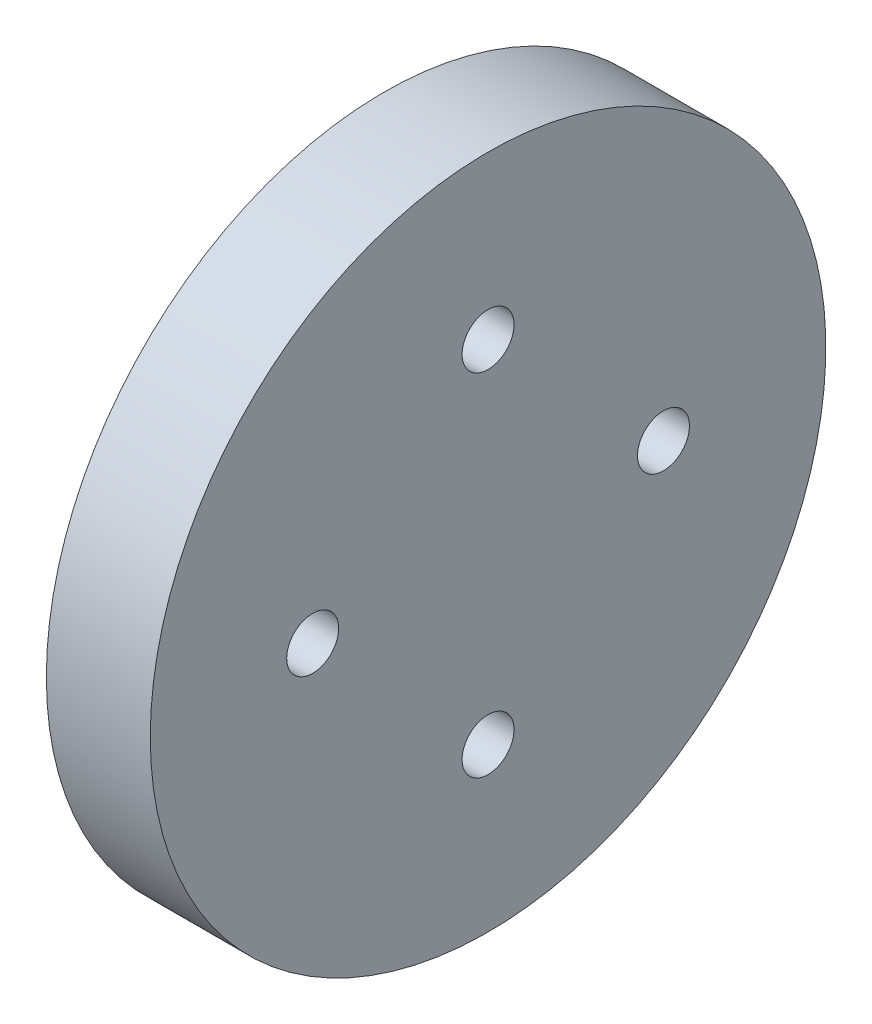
ISO-10303-21;
HEADER;
FILE_DESCRIPTION(('STEP AP214'),'2;1');
FILE_NAME('part.step','',(''),(''),'','','');
FILE_SCHEMA(('AUTOMOTIVE_DESIGN { 1 0 10303 214 1 1 1 1 }'));
ENDSEC;
DATA;
#1=APPLICATION_CONTEXT('core data for automotive mechanical design processes');
#2=APPLICATION_PROTOCOL_DEFINITION('international standard','automotive_design',2000,#1);
#3=PRODUCT_CONTEXT('',#1,'mechanical');
#4=PRODUCT('Part','Part','',(#3));
#5=PRODUCT_RELATED_PRODUCT_CATEGORY('part','',(#4));
#6=PRODUCT_DEFINITION_FORMATION('','',#4);
#7=PRODUCT_DEFINITION_CONTEXT('part definition',#1,'design');
#8=PRODUCT_DEFINITION('design','',#6,#7);
#9=PRODUCT_DEFINITION_SHAPE('','',#8);
#10=(LENGTH_UNIT() NAMED_UNIT(*) SI_UNIT(.MILLI.,.METRE.));
#11=(NAMED_UNIT(*) PLANE_ANGLE_UNIT() SI_UNIT($,.RADIAN.));
#12=(NAMED_UNIT(*) SI_UNIT($,.STERADIAN.) SOLID_ANGLE_UNIT());
#13=UNCERTAINTY_MEASURE_WITH_UNIT(LENGTH_MEASURE(1.E-05),#10,'distance_accuracy_value','');
#14=(GEOMETRIC_REPRESENTATION_CONTEXT(3) GLOBAL_UNCERTAINTY_ASSIGNED_CONTEXT((#13)) GLOBAL_UNIT_ASSIGNED_CONTEXT((#10,
#11,#12)) REPRESENTATION_CONTEXT('',''));
#15=CARTESIAN_POINT('',(0.,0.,0.));
#16=DIRECTION('',(0.,0.,1.));
#17=DIRECTION('',(1.,0.,0.));
#18=AXIS2_PLACEMENT_3D('',#15,#16,#17);
#19=CARTESIAN_POINT('',(0.,0.,0.));
#20=DIRECTION('',(1.,0.,0.));
#21=DIRECTION('',(0.,0.,-1.));
#22=AXIS2_PLACEMENT_3D('',#19,#20,#21);
#23=PLANE('',#22);
#24=CARTESIAN_POINT('',(0.,0.,0.));
#25=DIRECTION('',(1.,0.,0.));
#26=DIRECTION('',(0.,0.,-1.));
#27=AXIS2_PLACEMENT_3D('',#24,#25,#26);
#28=CIRCLE('',#27,3.);
#29=CARTESIAN_POINT('',(0.,0.,-3.));
#30=VERTEX_POINT('',#29);
#31=EDGE_CURVE('E352',#30,#30,#28,.F.);
#32=ORIENTED_EDGE('',*,*,#31,.T.);
#33=EDGE_LOOP('',(#32));
#34=FACE_BOUND('',#33,.T.);
#35=ADVANCED_FACE('F346',(#34),#23,.F.);
#36=CARTESIAN_POINT('',(0.,0.,0.));
#37=DIRECTION('',(-1.,0.,0.));
#38=DIRECTION('',(0.,0.,1.));
#39=AXIS2_PLACEMENT_3D('',#36,#37,#38);
#40=CYLINDRICAL_SURFACE('',#39,4.);
#41=CARTESIAN_POINT('',(1.,0.,0.));
#42=DIRECTION('',(1.,0.,0.));
#43=DIRECTION('',(0.,0.,-1.));
#44=AXIS2_PLACEMENT_3D('',#41,#42,#43);
#45=CIRCLE('',#44,4.);
#46=CARTESIAN_POINT('',(1.,0.,-4.));
#47=VERTEX_POINT('',#46);
#48=EDGE_CURVE('E10',#47,#47,#45,.T.);
#49=ORIENTED_EDGE('',*,*,#48,.T.);
#50=EDGE_LOOP('',(#49));
#51=FACE_BOUND('',#50,.T.);
#52=CARTESIAN_POINT('',(4.,0.,0.));
#53=DIRECTION('',(-1.,0.,0.));
#54=DIRECTION('',(0.,0.,1.));
#55=AXIS2_PLACEMENT_3D('',#52,#53,#54);
#56=CIRCLE('',#55,4.);
#57=CARTESIAN_POINT('',(4.,0.,4.));
#58=VERTEX_POINT('',#57);
#59=EDGE_CURVE('E356',#58,#58,#56,.T.);
#60=ORIENTED_EDGE('',*,*,#59,.T.);
#61=EDGE_LOOP('',(#60));
#62=FACE_BOUND('',#61,.T.);
#63=ADVANCED_FACE('F399',(#51,#62),#40,.T.);
#64=CARTESIAN_POINT('',(4.,4.,0.));
#65=DIRECTION('',(1.,0.,0.));
#66=DIRECTION('',(0.,0.,-1.));
#67=AXIS2_PLACEMENT_3D('',#64,#65,#66);
#68=PLANE('',#67);
#69=CARTESIAN_POINT('',(4.,0.,-6.75));
#70=DIRECTION('',(-1.,0.,0.));
#71=DIRECTION('',(0.,1.,0.));
#72=AXIS2_PLACEMENT_3D('',#69,#70,#71);
#73=CIRCLE('',#72,1.);
#74=CARTESIAN_POINT('',(4.,1.00000000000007,-6.74999999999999));
#75=VERTEX_POINT('',#74);
#76=EDGE_CURVE('E389',#75,#75,#73,.T.);
#77=ORIENTED_EDGE('',*,*,#76,.F.);
#78=EDGE_LOOP('',(#77));
#79=FACE_BOUND('',#78,.T.);
#80=CARTESIAN_POINT('',(4.,-6.75,0.));
#81=DIRECTION('',(-1.,0.,0.));
#82=DIRECTION('',(0.,0.,-1.));
#83=AXIS2_PLACEMENT_3D('',#80,#81,#82);
#84=CIRCLE('',#83,1.);
#85=CARTESIAN_POINT('',(4.,-6.74999999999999,-1.00000000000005));
#86=VERTEX_POINT('',#85);
#87=EDGE_CURVE('E383',#86,#86,#84,.T.);
#88=ORIENTED_EDGE('',*,*,#87,.F.);
#89=EDGE_LOOP('',(#88));
#90=FACE_BOUND('',#89,.T.);
#91=CARTESIAN_POINT('',(4.,0.,6.75));
#92=DIRECTION('',(-1.,0.,0.));
#93=DIRECTION('',(0.,-1.,0.));
#94=AXIS2_PLACEMENT_3D('',#91,#92,#93);
#95=CIRCLE('',#94,1.);
#96=CARTESIAN_POINT('',(4.,-1.00000000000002,6.75));
#97=VERTEX_POINT('',#96);
#98=EDGE_CURVE('E377',#97,#97,#95,.T.);
#99=ORIENTED_EDGE('',*,*,#98,.F.);
#100=EDGE_LOOP('',(#99));
#101=FACE_BOUND('',#100,.T.);
#102=CARTESIAN_POINT('',(4.,6.75,0.));
#103=DIRECTION('',(-1.,0.,0.));
#104=DIRECTION('',(0.,0.,1.));
#105=AXIS2_PLACEMENT_3D('',#102,#103,#104);
#106=CIRCLE('',#105,1.);
#107=CARTESIAN_POINT('',(4.,6.75,1.));
#108=VERTEX_POINT('',#107);
#109=EDGE_CURVE('E371',#108,#108,#106,.T.);
#110=ORIENTED_EDGE('',*,*,#109,.F.);
#111=EDGE_LOOP('',(#110));
#112=FACE_BOUND('',#111,.T.);
#113=ORIENTED_EDGE('',*,*,#59,.F.);
#114=EDGE_LOOP('',(#113));
#115=FACE_BOUND('',#114,.T.);
#116=CARTESIAN_POINT('',(4.,0.,0.));
#117=DIRECTION('',(-1.,0.,0.));
#118=DIRECTION('',(0.,0.,1.));
#119=AXIS2_PLACEMENT_3D('',#116,#117,#118);
#120=CIRCLE('',#119,13.);
#121=CARTESIAN_POINT('',(4.,0.,13.));
#122=VERTEX_POINT('',#121);
#123=EDGE_CURVE('E360',#122,#122,#120,.T.);
#124=ORIENTED_EDGE('',*,*,#123,.T.);
#125=EDGE_LOOP('',(#124));
#126=FACE_BOUND('',#125,.T.);
#127=ADVANCED_FACE('F395',(#79,#90,#101,#112,#115,#126),#68,.F.);
#128=CARTESIAN_POINT('',(0.,0.,0.));
#129=DIRECTION('',(-1.,0.,0.));
#130=DIRECTION('',(0.,0.,1.));
#131=AXIS2_PLACEMENT_3D('',#128,#129,#130);
#132=CYLINDRICAL_SURFACE('',#131,13.);
#133=ORIENTED_EDGE('',*,*,#123,.F.);
#134=EDGE_LOOP('',(#133));
#135=FACE_BOUND('',#134,.T.);
#136=CARTESIAN_POINT('',(8.,0.,0.));
#137=DIRECTION('',(-1.,0.,0.));
#138=DIRECTION('',(0.,0.,1.));
#139=AXIS2_PLACEMENT_3D('',#136,#137,#138);
#140=CIRCLE('',#139,13.);
#141=CARTESIAN_POINT('',(8.,0.,13.));
#142=VERTEX_POINT('',#141);
#143=EDGE_CURVE('E365',#142,#142,#140,.T.);
#144=ORIENTED_EDGE('',*,*,#143,.T.);
#145=EDGE_LOOP('',(#144));
#146=FACE_BOUND('',#145,.T.);
#147=ADVANCED_FACE('F398',(#135,#146),#132,.T.);
#148=CARTESIAN_POINT('',(8.,13.,0.));
#149=DIRECTION('',(-1.,0.,0.));
#150=DIRECTION('',(0.,0.,1.));
#151=AXIS2_PLACEMENT_3D('',#148,#149,#150);
#152=PLANE('',#151);
#153=CARTESIAN_POINT('',(8.,0.,-6.75));
#154=DIRECTION('',(-1.,0.,0.));
#155=DIRECTION('',(0.,1.,0.));
#156=AXIS2_PLACEMENT_3D('',#153,#154,#155);
#157=CIRCLE('',#156,1.);
#158=CARTESIAN_POINT('',(8.,1.00000000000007,-6.74999999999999));
#159=VERTEX_POINT('',#158);
#160=EDGE_CURVE('E386',#159,#159,#157,.T.);
#161=ORIENTED_EDGE('',*,*,#160,.T.);
#162=EDGE_LOOP('',(#161));
#163=FACE_BOUND('',#162,.T.);
#164=CARTESIAN_POINT('',(8.,-6.75,0.));
#165=DIRECTION('',(-1.,0.,0.));
#166=DIRECTION('',(0.,0.,-1.));
#167=AXIS2_PLACEMENT_3D('',#164,#165,#166);
#168=CIRCLE('',#167,1.);
#169=CARTESIAN_POINT('',(8.,-6.74999999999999,-1.00000000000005));
#170=VERTEX_POINT('',#169);
#171=EDGE_CURVE('E380',#170,#170,#168,.T.);
#172=ORIENTED_EDGE('',*,*,#171,.T.);
#173=EDGE_LOOP('',(#172));
#174=FACE_BOUND('',#173,.T.);
#175=CARTESIAN_POINT('',(8.,0.,6.75));
#176=DIRECTION('',(-1.,0.,0.));
#177=DIRECTION('',(0.,-1.,0.));
#178=AXIS2_PLACEMENT_3D('',#175,#176,#177);
#179=CIRCLE('',#178,1.);
#180=CARTESIAN_POINT('',(8.,-1.00000000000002,6.75));
#181=VERTEX_POINT('',#180);
#182=EDGE_CURVE('E374',#181,#181,#179,.T.);
#183=ORIENTED_EDGE('',*,*,#182,.T.);
#184=EDGE_LOOP('',(#183));
#185=FACE_BOUND('',#184,.T.);
#186=CARTESIAN_POINT('',(8.,6.75,0.));
#187=DIRECTION('',(-1.,0.,0.));
#188=DIRECTION('',(0.,0.,1.));
#189=AXIS2_PLACEMENT_3D('',#186,#187,#188);
#190=CIRCLE('',#189,1.);
#191=CARTESIAN_POINT('',(8.,6.75,1.));
#192=VERTEX_POINT('',#191);
#193=EDGE_CURVE('E368',#192,#192,#190,.T.);
#194=ORIENTED_EDGE('',*,*,#193,.T.);
#195=EDGE_LOOP('',(#194));
#196=FACE_BOUND('',#195,.T.);
#197=ORIENTED_EDGE('',*,*,#143,.F.);
#198=EDGE_LOOP('',(#197));
#199=FACE_BOUND('',#198,.T.);
#200=ADVANCED_FACE('F413',(#163,#174,#185,#196,#199),#152,.F.);
#201=CARTESIAN_POINT('',(0.,0.,0.));
#202=DIRECTION('',(1.,0.,0.));
#203=DIRECTION('',(0.,0.,-1.));
#204=AXIS2_PLACEMENT_3D('',#201,#202,#203);
#205=CONICAL_SURFACE('',#204,3.,0.785398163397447);
#206=ORIENTED_EDGE('',*,*,#48,.F.);
#207=EDGE_LOOP('',(#206));
#208=FACE_BOUND('',#207,.T.);
#209=ORIENTED_EDGE('',*,*,#31,.F.);
#210=EDGE_LOOP('',(#209));
#211=FACE_BOUND('',#210,.T.);
#212=ADVANCED_FACE('F418',(#208,#211),#205,.T.);
#213=CARTESIAN_POINT('',(8.,6.75,0.));
#214=DIRECTION('',(-1.,0.,0.));
#215=DIRECTION('',(0.,0.,1.));
#216=AXIS2_PLACEMENT_3D('',#213,#214,#215);
#217=CYLINDRICAL_SURFACE('',#216,1.);
#218=ORIENTED_EDGE('',*,*,#193,.F.);
#219=EDGE_LOOP('',(#218));
#220=FACE_BOUND('',#219,.T.);
#221=ORIENTED_EDGE('',*,*,#109,.T.);
#222=EDGE_LOOP('',(#221));
#223=FACE_BOUND('',#222,.T.);
#224=ADVANCED_FACE('F424',(#220,#223),#217,.F.);
#225=CARTESIAN_POINT('',(8.,0.,6.75));
#226=DIRECTION('',(-1.,0.,0.));
#227=DIRECTION('',(0.,0.,1.));
#228=AXIS2_PLACEMENT_3D('',#225,#226,#227);
#229=CYLINDRICAL_SURFACE('',#228,1.);
#230=ORIENTED_EDGE('',*,*,#182,.F.);
#231=EDGE_LOOP('',(#230));
#232=FACE_BOUND('',#231,.T.);
#233=ORIENTED_EDGE('',*,*,#98,.T.);
#234=EDGE_LOOP('',(#233));
#235=FACE_BOUND('',#234,.T.);
#236=ADVANCED_FACE('F456',(#232,#235),#229,.F.);
#237=CARTESIAN_POINT('',(8.,-6.75,0.));
#238=DIRECTION('',(-1.,0.,0.));
#239=DIRECTION('',(0.,0.,1.));
#240=AXIS2_PLACEMENT_3D('',#237,#238,#239);
#241=CYLINDRICAL_SURFACE('',#240,1.);
#242=ORIENTED_EDGE('',*,*,#171,.F.);
#243=EDGE_LOOP('',(#242));
#244=FACE_BOUND('',#243,.T.);
#245=ORIENTED_EDGE('',*,*,#87,.T.);
#246=EDGE_LOOP('',(#245));
#247=FACE_BOUND('',#246,.T.);
#248=ADVANCED_FACE('F464',(#244,#247),#241,.F.);
#249=CARTESIAN_POINT('',(8.,0.,-6.75));
#250=DIRECTION('',(-1.,0.,0.));
#251=DIRECTION('',(0.,0.,1.));
#252=AXIS2_PLACEMENT_3D('',#249,#250,#251);
#253=CYLINDRICAL_SURFACE('',#252,1.);
#254=ORIENTED_EDGE('',*,*,#160,.F.);
#255=EDGE_LOOP('',(#254));
#256=FACE_BOUND('',#255,.T.);
#257=ORIENTED_EDGE('',*,*,#76,.T.);
#258=EDGE_LOOP('',(#257));
#259=FACE_BOUND('',#258,.T.);
#260=ADVANCED_FACE('F393',(#256,#259),#253,.F.);
#261=CLOSED_SHELL('',(#35,#63,#127,#147,#200,#212,#224,#236,#248,#260));
#262=MANIFOLD_SOLID_BREP('B2',#261);
#263=ADVANCED_BREP_SHAPE_REPRESENTATION('',(#18,#262),#14);
#264=SHAPE_DEFINITION_REPRESENTATION(#9,#263);
ENDSEC;
END-ISO-10303-21;
